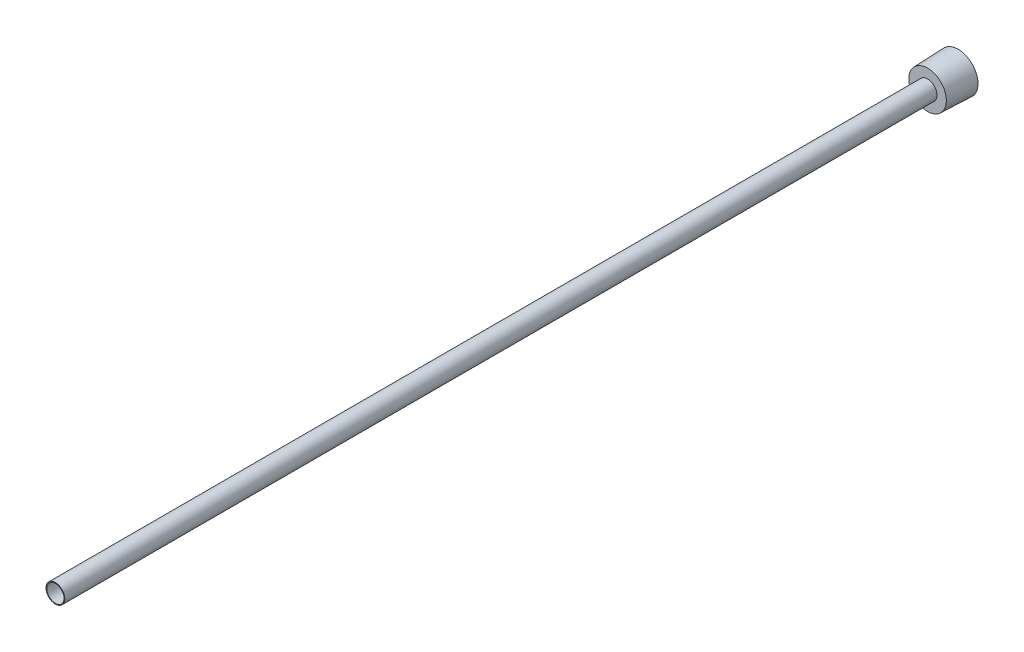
ISO-10303-21;
HEADER;
FILE_DESCRIPTION(('STEP AP214'),'2;1');
FILE_NAME('part.step','',(''),(''),'','','');
FILE_SCHEMA(('AUTOMOTIVE_DESIGN { 1 0 10303 214 1 1 1 1 }'));
ENDSEC;
DATA;
#1=APPLICATION_CONTEXT('core data for automotive mechanical design processes');
#2=APPLICATION_PROTOCOL_DEFINITION('international standard','automotive_design',2000,#1);
#3=PRODUCT_CONTEXT('',#1,'mechanical');
#4=PRODUCT('Part','Part','',(#3));
#5=PRODUCT_RELATED_PRODUCT_CATEGORY('part','',(#4));
#6=PRODUCT_DEFINITION_FORMATION('','',#4);
#7=PRODUCT_DEFINITION_CONTEXT('part definition',#1,'design');
#8=PRODUCT_DEFINITION('design','',#6,#7);
#9=PRODUCT_DEFINITION_SHAPE('','',#8);
#10=(LENGTH_UNIT() NAMED_UNIT(*) SI_UNIT(.MILLI.,.METRE.));
#11=(NAMED_UNIT(*) PLANE_ANGLE_UNIT() SI_UNIT($,.RADIAN.));
#12=(NAMED_UNIT(*) SI_UNIT($,.STERADIAN.) SOLID_ANGLE_UNIT());
#13=UNCERTAINTY_MEASURE_WITH_UNIT(LENGTH_MEASURE(1.E-05),#10,'distance_accuracy_value','');
#14=(GEOMETRIC_REPRESENTATION_CONTEXT(3) GLOBAL_UNCERTAINTY_ASSIGNED_CONTEXT((#13)) GLOBAL_UNIT_ASSIGNED_CONTEXT((#10,
#11,#12)) REPRESENTATION_CONTEXT('',''));
#15=CARTESIAN_POINT('',(0.,0.,0.));
#16=DIRECTION('',(0.,0.,1.));
#17=DIRECTION('',(1.,0.,0.));
#18=AXIS2_PLACEMENT_3D('',#15,#16,#17);
#19=CARTESIAN_POINT('',(0.,0.,0.));
#20=DIRECTION('',(0.,0.,1.));
#21=DIRECTION('',(1.,0.,0.));
#22=AXIS2_PLACEMENT_3D('',#19,#20,#21);
#23=CYLINDRICAL_SURFACE('',#22,2.921);
#24=CARTESIAN_POINT('',(0.,0.,304.8));
#25=DIRECTION('',(0.,0.,1.));
#26=DIRECTION('',(1.,0.,0.));
#27=AXIS2_PLACEMENT_3D('',#24,#25,#26);
#28=CIRCLE('',#27,2.921);
#29=CARTESIAN_POINT('',(2.921,0.,304.8));
#30=VERTEX_POINT('',#29);
#31=EDGE_CURVE('E142',#30,#30,#28,.T.);
#32=CARTESIAN_POINT('',(0.,0.,6.35));
#33=DIRECTION('',(0.,0.,-1.));
#34=DIRECTION('',(-1.,0.,0.));
#35=AXIS2_PLACEMENT_3D('',#32,#33,#34);
#36=CIRCLE('',#35,2.921);
#37=CARTESIAN_POINT('',(2.921,0.,6.35));
#38=VERTEX_POINT('',#37);
#39=EDGE_CURVE('E37',#38,#38,#36,.F.);
#40=CARTESIAN_POINT('',(2.921,0.,304.8));
#41=CARTESIAN_POINT('',(2.921,0.,301.691145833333));
#42=CARTESIAN_POINT('',(2.921,0.,298.582291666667));
#43=CARTESIAN_POINT('',(2.921,0.,292.364583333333));
#44=CARTESIAN_POINT('',(2.921,0.,289.255729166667));
#45=CARTESIAN_POINT('',(2.921,0.,283.038020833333));
#46=CARTESIAN_POINT('',(2.921,0.,279.929166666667));
#47=CARTESIAN_POINT('',(2.921,0.,273.711458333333));
#48=CARTESIAN_POINT('',(2.921,0.,270.602604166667));
#49=CARTESIAN_POINT('',(2.921,0.,264.384895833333));
#50=CARTESIAN_POINT('',(2.921,0.,261.276041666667));
#51=CARTESIAN_POINT('',(2.921,0.,255.058333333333));
#52=CARTESIAN_POINT('',(2.921,0.,251.949479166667));
#53=CARTESIAN_POINT('',(2.921,0.,245.731770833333));
#54=CARTESIAN_POINT('',(2.921,0.,242.622916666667));
#55=CARTESIAN_POINT('',(2.921,0.,236.405208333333));
#56=CARTESIAN_POINT('',(2.921,0.,233.296354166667));
#57=CARTESIAN_POINT('',(2.921,0.,227.078645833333));
#58=CARTESIAN_POINT('',(2.921,0.,223.969791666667));
#59=CARTESIAN_POINT('',(2.921,0.,217.752083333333));
#60=CARTESIAN_POINT('',(2.921,0.,214.643229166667));
#61=CARTESIAN_POINT('',(2.921,0.,208.425520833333));
#62=CARTESIAN_POINT('',(2.921,0.,205.316666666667));
#63=CARTESIAN_POINT('',(2.921,0.,199.098958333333));
#64=CARTESIAN_POINT('',(2.921,0.,195.990104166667));
#65=CARTESIAN_POINT('',(2.921,0.,189.772395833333));
#66=CARTESIAN_POINT('',(2.921,0.,186.663541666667));
#67=CARTESIAN_POINT('',(2.921,0.,180.445833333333));
#68=CARTESIAN_POINT('',(2.921,0.,177.336979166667));
#69=CARTESIAN_POINT('',(2.921,0.,171.119270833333));
#70=CARTESIAN_POINT('',(2.921,0.,168.010416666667));
#71=CARTESIAN_POINT('',(2.921,0.,161.792708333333));
#72=CARTESIAN_POINT('',(2.921,0.,158.683854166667));
#73=CARTESIAN_POINT('',(2.921,0.,152.466145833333));
#74=CARTESIAN_POINT('',(2.921,0.,149.357291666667));
#75=CARTESIAN_POINT('',(2.921,0.,143.139583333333));
#76=CARTESIAN_POINT('',(2.921,0.,140.030729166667));
#77=CARTESIAN_POINT('',(2.921,0.,133.813020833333));
#78=CARTESIAN_POINT('',(2.921,0.,130.704166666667));
#79=CARTESIAN_POINT('',(2.921,0.,124.486458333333));
#80=CARTESIAN_POINT('',(2.921,0.,121.377604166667));
#81=CARTESIAN_POINT('',(2.921,0.,115.159895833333));
#82=CARTESIAN_POINT('',(2.921,0.,112.051041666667));
#83=CARTESIAN_POINT('',(2.921,0.,105.833333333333));
#84=CARTESIAN_POINT('',(2.921,0.,102.724479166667));
#85=CARTESIAN_POINT('',(2.921,0.,96.5067708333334));
#86=CARTESIAN_POINT('',(2.921,0.,93.3979166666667));
#87=CARTESIAN_POINT('',(2.921,0.,87.1802083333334));
#88=CARTESIAN_POINT('',(2.921,0.,84.0713541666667));
#89=CARTESIAN_POINT('',(2.921,0.,77.8536458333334));
#90=CARTESIAN_POINT('',(2.921,0.,74.7447916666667));
#91=CARTESIAN_POINT('',(2.921,0.,68.5270833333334));
#92=CARTESIAN_POINT('',(2.921,0.,65.4182291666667));
#93=CARTESIAN_POINT('',(2.921,0.,59.2005208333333));
#94=CARTESIAN_POINT('',(2.921,0.,56.0916666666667));
#95=CARTESIAN_POINT('',(2.921,0.,49.8739583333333));
#96=CARTESIAN_POINT('',(2.921,0.,46.7651041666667));
#97=CARTESIAN_POINT('',(2.921,0.,40.5473958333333));
#98=CARTESIAN_POINT('',(2.921,0.,37.4385416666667));
#99=CARTESIAN_POINT('',(2.921,0.,31.2208333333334));
#100=CARTESIAN_POINT('',(2.921,0.,28.1119791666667));
#101=CARTESIAN_POINT('',(2.921,0.,21.8942708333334));
#102=CARTESIAN_POINT('',(2.921,0.,18.7854166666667));
#103=CARTESIAN_POINT('',(2.921,0.,12.5677083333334));
#104=CARTESIAN_POINT('',(2.921,0.,9.45885416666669));
#105=CARTESIAN_POINT('',(2.921,0.,6.35000000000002));
#106=B_SPLINE_CURVE_WITH_KNOTS('',3,(#40,#41,#42,#43,#44,#45,#46,#47,#48,#49,#50,#51,#52,#53,
#54,#55,#56,#57,#58,#59,#60,#61,#62,#63,#64,#65,#66,#67,#68,#69,#70,#71,#72,#73,#74,#75,#76,#77,
#78,#79,#80,#81,#82,#83,#84,#85,#86,#87,#88,#89,#90,#91,#92,#93,#94,#95,#96,#97,#98,#99,#100,
#101,#102,#103,#104,#105),.UNSPECIFIED.,.F.,.F.,(4,2,2,2,2,2,2,2,2,2,2,2,2,2,2,2,2,2,2,2,2,2,2,
2,2,2,2,2,2,2,2,2,4),(0.,9.32656250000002,18.653125,27.9796875,37.30625,46.6328125,55.959375,
65.2859375,74.6125,83.9390625,93.265625,102.5921875,111.91875,121.2453125,130.571875,
139.8984375,149.225,158.5515625,167.878125,177.2046875,186.53125,195.8578125,205.184375,
214.5109375,223.8375,233.1640625,242.490625,251.8171875,261.14375,270.4703125,279.796875,
289.1234375,298.45),.UNSPECIFIED.);
#107=EDGE_CURVE('BSEAM33',#30,#38,#106,.T.);
#108=ORIENTED_EDGE('',*,*,#31,.T.);
#109=ORIENTED_EDGE('',*,*,#39,.F.);
#110=ORIENTED_EDGE('',*,*,#107,.T.);
#111=ORIENTED_EDGE('',*,*,#107,.F.);
#112=EDGE_LOOP('',(#108,#110,#109,#111));
#113=FACE_BOUND('',#112,.T.);
#114=ADVANCED_FACE('F33',(#113),#23,.F.);
#115=CARTESIAN_POINT('',(0.,0.,0.));
#116=DIRECTION('',(0.,0.,-1.));
#117=DIRECTION('',(-1.,0.,0.));
#118=AXIS2_PLACEMENT_3D('',#115,#116,#117);
#119=CONICAL_SURFACE('',#118,6.7183,0.0364599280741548);
#120=CARTESIAN_POINT('',(0.,0.,10.3124));
#121=DIRECTION('',(0.,0.,1.));
#122=DIRECTION('',(1.,0.,0.));
#123=AXIS2_PLACEMENT_3D('',#120,#121,#122);
#124=CIRCLE('',#123,6.34214394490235);
#125=CARTESIAN_POINT('',(6.34214394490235,0.,10.3124));
#126=VERTEX_POINT('',#125);
#127=EDGE_CURVE('E11',#126,#126,#124,.T.);
#128=ORIENTED_EDGE('',*,*,#127,.F.);
#129=EDGE_LOOP('',(#128));
#130=FACE_BOUND('',#129,.T.);
#131=CARTESIAN_POINT('',(0.,0.,0.));
#132=DIRECTION('',(0.,0.,1.));
#133=DIRECTION('',(1.,0.,0.));
#134=AXIS2_PLACEMENT_3D('',#131,#132,#133);
#135=CIRCLE('',#134,6.7183);
#136=CARTESIAN_POINT('',(6.7183,0.,0.));
#137=VERTEX_POINT('',#136);
#138=EDGE_CURVE('E145',#137,#137,#135,.T.);
#139=ORIENTED_EDGE('',*,*,#138,.T.);
#140=EDGE_LOOP('',(#139));
#141=FACE_BOUND('',#140,.T.);
#142=ADVANCED_FACE('F35',(#130,#141),#119,.T.);
#143=CARTESIAN_POINT('',(0.,6.34214394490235,10.3124));
#144=DIRECTION('',(0.,0.,-1.));
#145=DIRECTION('',(-1.,0.,0.));
#146=AXIS2_PLACEMENT_3D('',#143,#144,#145);
#147=PLANE('',#146);
#148=CARTESIAN_POINT('',(0.,0.,10.3124));
#149=DIRECTION('',(0.,0.,1.));
#150=DIRECTION('',(1.,0.,0.));
#151=AXIS2_PLACEMENT_3D('',#148,#149,#150);
#152=CIRCLE('',#151,3.175);
#153=CARTESIAN_POINT('',(3.175,0.,10.3124));
#154=VERTEX_POINT('',#153);
#155=EDGE_CURVE('E42',#154,#154,#152,.T.);
#156=ORIENTED_EDGE('',*,*,#155,.F.);
#157=EDGE_LOOP('',(#156));
#158=FACE_BOUND('',#157,.T.);
#159=ORIENTED_EDGE('',*,*,#127,.T.);
#160=EDGE_LOOP('',(#159));
#161=FACE_BOUND('',#160,.T.);
#162=ADVANCED_FACE('F156',(#158,#161),#147,.F.);
#163=CARTESIAN_POINT('',(0.,0.,331.124179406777));
#164=DIRECTION('',(0.,0.,1.));
#165=DIRECTION('',(1.,0.,0.));
#166=AXIS2_PLACEMENT_3D('',#163,#164,#165);
#167=CYLINDRICAL_SURFACE('',#166,3.175);
#168=CARTESIAN_POINT('',(0.,0.,304.8));
#169=DIRECTION('',(0.,0.,1.));
#170=DIRECTION('',(1.,0.,0.));
#171=AXIS2_PLACEMENT_3D('',#168,#169,#170);
#172=CIRCLE('',#171,3.175);
#173=CARTESIAN_POINT('',(3.175,0.,304.8));
#174=VERTEX_POINT('',#173);
#175=EDGE_CURVE('E148',#174,#174,#172,.T.);
#176=ORIENTED_EDGE('',*,*,#175,.F.);
#177=EDGE_LOOP('',(#176));
#178=FACE_BOUND('',#177,.T.);
#179=ORIENTED_EDGE('',*,*,#155,.T.);
#180=EDGE_LOOP('',(#179));
#181=FACE_BOUND('',#180,.T.);
#182=ADVANCED_FACE('F154',(#178,#181),#167,.T.);
#183=CARTESIAN_POINT('',(0.,3.175,304.8));
#184=DIRECTION('',(0.,0.,-1.));
#185=DIRECTION('',(-1.,0.,0.));
#186=AXIS2_PLACEMENT_3D('',#183,#184,#185);
#187=PLANE('',#186);
#188=ORIENTED_EDGE('',*,*,#31,.F.);
#189=EDGE_LOOP('',(#188));
#190=FACE_BOUND('',#189,.T.);
#191=ORIENTED_EDGE('',*,*,#175,.T.);
#192=EDGE_LOOP('',(#191));
#193=FACE_BOUND('',#192,.T.);
#194=ADVANCED_FACE('F167',(#190,#193),#187,.F.);
#195=CARTESIAN_POINT('',(0.,0.,0.));
#196=DIRECTION('',(0.,0.,1.));
#197=DIRECTION('',(1.,0.,0.));
#198=AXIS2_PLACEMENT_3D('',#195,#196,#197);
#199=PLANE('',#198);
#200=DIRECTION('',(-0.866025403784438,-0.5,0.));
#201=VECTOR('',#200,1.);
#202=CARTESIAN_POINT('',(3.175,-1.83308710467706,0.));
#203=LINE('',#202,#201);
#204=CARTESIAN_POINT('',(3.175,-1.83308710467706,0.));
#205=VERTEX_POINT('',#204);
#206=CARTESIAN_POINT('',(0.,-3.66617420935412,0.));
#207=VERTEX_POINT('',#206);
#208=EDGE_CURVE('E124',#205,#207,#203,.T.);
#209=ORIENTED_EDGE('',*,*,#208,.F.);
#210=DIRECTION('',(0.,-1.,0.));
#211=VECTOR('',#210,1.);
#212=CARTESIAN_POINT('',(3.175,1.83308710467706,0.));
#213=LINE('',#212,#211);
#214=CARTESIAN_POINT('',(3.175,1.83308710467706,0.));
#215=VERTEX_POINT('',#214);
#216=EDGE_CURVE('E49',#215,#205,#213,.T.);
#217=ORIENTED_EDGE('',*,*,#216,.F.);
#218=DIRECTION('',(0.866025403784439,-0.5,0.));
#219=VECTOR('',#218,1.);
#220=CARTESIAN_POINT('',(0.,3.66617420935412,0.));
#221=LINE('',#220,#219);
#222=CARTESIAN_POINT('',(0.,3.66617420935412,0.));
#223=VERTEX_POINT('',#222);
#224=EDGE_CURVE('E133',#223,#215,#221,.T.);
#225=ORIENTED_EDGE('',*,*,#224,.F.);
#226=DIRECTION('',(0.866025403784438,0.5,0.));
#227=VECTOR('',#226,1.);
#228=CARTESIAN_POINT('',(-3.175,1.83308710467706,0.));
#229=LINE('',#228,#227);
#230=CARTESIAN_POINT('',(-3.175,1.83308710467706,0.));
#231=VERTEX_POINT('',#230);
#232=EDGE_CURVE('E131',#231,#223,#229,.T.);
#233=ORIENTED_EDGE('',*,*,#232,.F.);
#234=DIRECTION('',(0.,1.,0.));
#235=VECTOR('',#234,1.);
#236=CARTESIAN_POINT('',(-3.175,-1.83308710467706,0.));
#237=LINE('',#236,#235);
#238=CARTESIAN_POINT('',(-3.175,-1.83308710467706,0.));
#239=VERTEX_POINT('',#238);
#240=EDGE_CURVE('E97',#239,#231,#237,.T.);
#241=ORIENTED_EDGE('',*,*,#240,.F.);
#242=DIRECTION('',(-0.866025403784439,0.5,0.));
#243=VECTOR('',#242,1.);
#244=CARTESIAN_POINT('',(0.,-3.66617420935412,0.));
#245=LINE('',#244,#243);
#246=EDGE_CURVE('E127',#207,#239,#245,.T.);
#247=ORIENTED_EDGE('',*,*,#246,.F.);
#248=EDGE_LOOP('',(#209,#217,#225,#233,#241,#247));
#249=FACE_BOUND('',#248,.T.);
#250=ORIENTED_EDGE('',*,*,#138,.F.);
#251=EDGE_LOOP('',(#250));
#252=FACE_BOUND('',#251,.T.);
#253=ADVANCED_FACE('F165',(#249,#252),#199,.F.);
#254=CARTESIAN_POINT('',(3.175,-1.83308710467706,6.35));
#255=DIRECTION('',(0.,0.,-1.));
#256=DIRECTION('',(-1.,0.,0.));
#257=AXIS2_PLACEMENT_3D('',#254,#255,#256);
#258=PLANE('',#257);
#259=DIRECTION('',(0.,-1.,0.));
#260=VECTOR('',#259,1.);
#261=CARTESIAN_POINT('',(3.175,1.83308710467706,6.35));
#262=LINE('',#261,#260);
#263=CARTESIAN_POINT('',(3.175,1.83308710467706,6.35));
#264=VERTEX_POINT('',#263);
#265=CARTESIAN_POINT('',(3.175,-1.83308710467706,6.35));
#266=VERTEX_POINT('',#265);
#267=EDGE_CURVE('E135',#264,#266,#262,.T.);
#268=ORIENTED_EDGE('',*,*,#267,.T.);
#269=DIRECTION('',(-0.866025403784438,-0.5,0.));
#270=VECTOR('',#269,1.);
#271=CARTESIAN_POINT('',(3.175,-1.83308710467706,6.35));
#272=LINE('',#271,#270);
#273=CARTESIAN_POINT('',(0.,-3.66617420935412,6.35));
#274=VERTEX_POINT('',#273);
#275=EDGE_CURVE('E118',#266,#274,#272,.T.);
#276=ORIENTED_EDGE('',*,*,#275,.T.);
#277=DIRECTION('',(-0.866025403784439,0.5,0.));
#278=VECTOR('',#277,1.);
#279=CARTESIAN_POINT('',(0.,-3.66617420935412,6.35));
#280=LINE('',#279,#278);
#281=CARTESIAN_POINT('',(-3.175,-1.83308710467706,6.35));
#282=VERTEX_POINT('',#281);
#283=EDGE_CURVE('E116',#274,#282,#280,.T.);
#284=ORIENTED_EDGE('',*,*,#283,.T.);
#285=DIRECTION('',(0.,1.,0.));
#286=VECTOR('',#285,1.);
#287=CARTESIAN_POINT('',(-3.175,-1.83308710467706,6.35));
#288=LINE('',#287,#286);
#289=CARTESIAN_POINT('',(-3.175,1.83308710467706,6.35));
#290=VERTEX_POINT('',#289);
#291=EDGE_CURVE('E94',#282,#290,#288,.T.);
#292=ORIENTED_EDGE('',*,*,#291,.T.);
#293=DIRECTION('',(0.866025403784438,0.5,0.));
#294=VECTOR('',#293,1.);
#295=CARTESIAN_POINT('',(-3.175,1.83308710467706,6.35));
#296=LINE('',#295,#294);
#297=CARTESIAN_POINT('',(0.,3.66617420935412,6.35));
#298=VERTEX_POINT('',#297);
#299=EDGE_CURVE('E105',#290,#298,#296,.T.);
#300=ORIENTED_EDGE('',*,*,#299,.T.);
#301=DIRECTION('',(0.866025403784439,-0.5,0.));
#302=VECTOR('',#301,1.);
#303=CARTESIAN_POINT('',(0.,3.66617420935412,6.35));
#304=LINE('',#303,#302);
#305=EDGE_CURVE('E109',#298,#264,#304,.T.);
#306=ORIENTED_EDGE('',*,*,#305,.T.);
#307=EDGE_LOOP('',(#268,#276,#284,#292,#300,#306));
#308=FACE_BOUND('',#307,.T.);
#309=ORIENTED_EDGE('',*,*,#39,.T.);
#310=EDGE_LOOP('',(#309));
#311=FACE_BOUND('',#310,.T.);
#312=ADVANCED_FACE('F112',(#308,#311),#258,.T.);
#313=CARTESIAN_POINT('',(3.175,1.83308710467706,6.35));
#314=DIRECTION('',(1.,0.,0.));
#315=DIRECTION('',(0.,1.,0.));
#316=AXIS2_PLACEMENT_3D('',#313,#314,#315);
#317=PLANE('',#316);
#318=ORIENTED_EDGE('',*,*,#216,.T.);
#319=DIRECTION('',(0.,0.,-1.));
#320=VECTOR('',#319,1.);
#321=CARTESIAN_POINT('',(3.175,-1.83308710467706,6.35));
#322=LINE('',#321,#320);
#323=EDGE_CURVE('E79',#266,#205,#322,.T.);
#324=ORIENTED_EDGE('',*,*,#323,.F.);
#325=ORIENTED_EDGE('',*,*,#267,.F.);
#326=DIRECTION('',(0.,0.,-1.));
#327=VECTOR('',#326,1.);
#328=CARTESIAN_POINT('',(3.175,1.83308710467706,6.35));
#329=LINE('',#328,#327);
#330=EDGE_CURVE('E57',#264,#215,#329,.T.);
#331=ORIENTED_EDGE('',*,*,#330,.T.);
#332=EDGE_LOOP('',(#318,#324,#325,#331));
#333=FACE_BOUND('',#332,.T.);
#334=ADVANCED_FACE('F174',(#333),#317,.F.);
#335=CARTESIAN_POINT('',(0.,3.66617420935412,6.35));
#336=DIRECTION('',(0.5,0.866025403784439,0.));
#337=DIRECTION('',(-0.866025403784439,0.5,0.));
#338=AXIS2_PLACEMENT_3D('',#335,#336,#337);
#339=PLANE('',#338);
#340=ORIENTED_EDGE('',*,*,#224,.T.);
#341=ORIENTED_EDGE('',*,*,#330,.F.);
#342=ORIENTED_EDGE('',*,*,#305,.F.);
#343=DIRECTION('',(0.,0.,-1.));
#344=VECTOR('',#343,1.);
#345=CARTESIAN_POINT('',(0.,3.66617420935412,6.35));
#346=LINE('',#345,#344);
#347=EDGE_CURVE('E101',#298,#223,#346,.T.);
#348=ORIENTED_EDGE('',*,*,#347,.T.);
#349=EDGE_LOOP('',(#340,#341,#342,#348));
#350=FACE_BOUND('',#349,.T.);
#351=ADVANCED_FACE('F188',(#350),#339,.F.);
#352=CARTESIAN_POINT('',(-3.175,1.83308710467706,6.35));
#353=DIRECTION('',(-0.5,0.866025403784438,0.));
#354=DIRECTION('',(-0.866025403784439,-0.5,0.));
#355=AXIS2_PLACEMENT_3D('',#352,#353,#354);
#356=PLANE('',#355);
#357=ORIENTED_EDGE('',*,*,#232,.T.);
#358=ORIENTED_EDGE('',*,*,#347,.F.);
#359=ORIENTED_EDGE('',*,*,#299,.F.);
#360=DIRECTION('',(0.,0.,-1.));
#361=VECTOR('',#360,1.);
#362=CARTESIAN_POINT('',(-3.175,1.83308710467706,6.35));
#363=LINE('',#362,#361);
#364=EDGE_CURVE('E90',#290,#231,#363,.T.);
#365=ORIENTED_EDGE('',*,*,#364,.T.);
#366=EDGE_LOOP('',(#357,#358,#359,#365));
#367=FACE_BOUND('',#366,.T.);
#368=ADVANCED_FACE('F106',(#367),#356,.F.);
#369=CARTESIAN_POINT('',(-3.175,-1.83308710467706,6.35));
#370=DIRECTION('',(-1.,0.,0.));
#371=DIRECTION('',(0.,0.,1.));
#372=AXIS2_PLACEMENT_3D('',#369,#370,#371);
#373=PLANE('',#372);
#374=ORIENTED_EDGE('',*,*,#240,.T.);
#375=ORIENTED_EDGE('',*,*,#364,.F.);
#376=ORIENTED_EDGE('',*,*,#291,.F.);
#377=DIRECTION('',(0.,0.,-1.));
#378=VECTOR('',#377,1.);
#379=CARTESIAN_POINT('',(-3.175,-1.83308710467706,6.35));
#380=LINE('',#379,#378);
#381=EDGE_CURVE('E102',#282,#239,#380,.T.);
#382=ORIENTED_EDGE('',*,*,#381,.T.);
#383=EDGE_LOOP('',(#374,#375,#376,#382));
#384=FACE_BOUND('',#383,.T.);
#385=ADVANCED_FACE('F92',(#384),#373,.F.);
#386=CARTESIAN_POINT('',(0.,-3.66617420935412,6.35));
#387=DIRECTION('',(-0.5,-0.866025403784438,0.));
#388=DIRECTION('',(0.866025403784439,-0.5,0.));
#389=AXIS2_PLACEMENT_3D('',#386,#387,#388);
#390=PLANE('',#389);
#391=ORIENTED_EDGE('',*,*,#246,.T.);
#392=ORIENTED_EDGE('',*,*,#381,.F.);
#393=ORIENTED_EDGE('',*,*,#283,.F.);
#394=DIRECTION('',(0.,0.,-1.));
#395=VECTOR('',#394,1.);
#396=CARTESIAN_POINT('',(0.,-3.66617420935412,6.35));
#397=LINE('',#396,#395);
#398=EDGE_CURVE('E139',#274,#207,#397,.T.);
#399=ORIENTED_EDGE('',*,*,#398,.T.);
#400=EDGE_LOOP('',(#391,#392,#393,#399));
#401=FACE_BOUND('',#400,.T.);
#402=ADVANCED_FACE('F192',(#401),#390,.F.);
#403=CARTESIAN_POINT('',(3.175,-1.83308710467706,6.35));
#404=DIRECTION('',(0.5,-0.866025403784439,0.));
#405=DIRECTION('',(0.866025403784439,0.5,0.));
#406=AXIS2_PLACEMENT_3D('',#403,#404,#405);
#407=PLANE('',#406);
#408=ORIENTED_EDGE('',*,*,#208,.T.);
#409=ORIENTED_EDGE('',*,*,#398,.F.);
#410=ORIENTED_EDGE('',*,*,#275,.F.);
#411=ORIENTED_EDGE('',*,*,#323,.T.);
#412=EDGE_LOOP('',(#408,#409,#410,#411));
#413=FACE_BOUND('',#412,.T.);
#414=ADVANCED_FACE('F189',(#413),#407,.F.);
#415=CLOSED_SHELL('',(#114,#142,#162,#182,#194,#253,#312,#334,#351,#368,#385,#402,#414));
#416=MANIFOLD_SOLID_BREP('B2',#415);
#417=ADVANCED_BREP_SHAPE_REPRESENTATION('',(#18,#416),#14);
#418=SHAPE_DEFINITION_REPRESENTATION(#9,#417);
ENDSEC;
END-ISO-10303-21;
